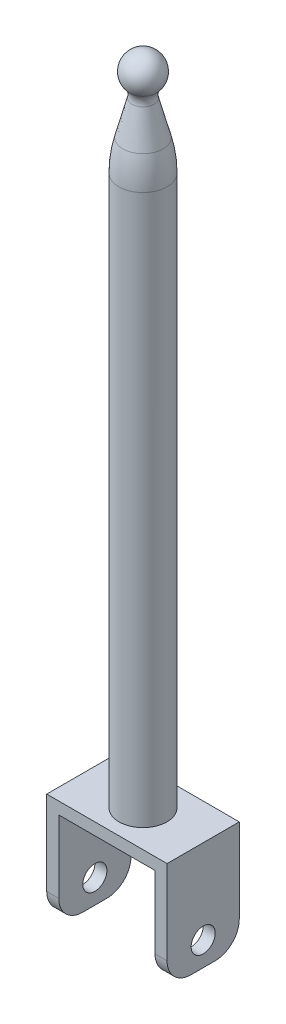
ISO-10303-21;
HEADER;
FILE_DESCRIPTION(('STEP AP214'),'2;1');
FILE_NAME('part.step','',(''),(''),'','','');
FILE_SCHEMA(('AUTOMOTIVE_DESIGN { 1 0 10303 214 1 1 1 1 }'));
ENDSEC;
DATA;
#1=APPLICATION_CONTEXT('core data for automotive mechanical design processes');
#2=APPLICATION_PROTOCOL_DEFINITION('international standard','automotive_design',2000,#1);
#3=PRODUCT_CONTEXT('',#1,'mechanical');
#4=PRODUCT('Part','Part','',(#3));
#5=PRODUCT_RELATED_PRODUCT_CATEGORY('part','',(#4));
#6=PRODUCT_DEFINITION_FORMATION('','',#4);
#7=PRODUCT_DEFINITION_CONTEXT('part definition',#1,'design');
#8=PRODUCT_DEFINITION('design','',#6,#7);
#9=PRODUCT_DEFINITION_SHAPE('','',#8);
#10=(LENGTH_UNIT() NAMED_UNIT(*) SI_UNIT(.MILLI.,.METRE.));
#11=(NAMED_UNIT(*) PLANE_ANGLE_UNIT() SI_UNIT($,.RADIAN.));
#12=(NAMED_UNIT(*) SI_UNIT($,.STERADIAN.) SOLID_ANGLE_UNIT());
#13=UNCERTAINTY_MEASURE_WITH_UNIT(LENGTH_MEASURE(1.E-05),#10,'distance_accuracy_value','');
#14=(GEOMETRIC_REPRESENTATION_CONTEXT(3) GLOBAL_UNCERTAINTY_ASSIGNED_CONTEXT((#13)) GLOBAL_UNIT_ASSIGNED_CONTEXT((#10,
#11,#12)) REPRESENTATION_CONTEXT('',''));
#15=CARTESIAN_POINT('',(0.,0.,0.));
#16=DIRECTION('',(0.,0.,1.));
#17=DIRECTION('',(1.,0.,0.));
#18=AXIS2_PLACEMENT_3D('',#15,#16,#17);
#19=CARTESIAN_POINT('',(0.,-9.99999999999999,0.));
#20=DIRECTION('',(0.,1.,0.));
#21=DIRECTION('',(0.,0.,1.));
#22=AXIS2_PLACEMENT_3D('',#19,#20,#21);
#23=PLANE('',#22);
#24=DIRECTION('',(0.,0.,1.));
#25=VECTOR('',#24,1.);
#26=CARTESIAN_POINT('',(25.,-9.99999999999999,-15.));
#27=LINE('',#26,#25);
#28=CARTESIAN_POINT('',(25.,-9.99999999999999,-5.));
#29=VERTEX_POINT('',#28);
#30=CARTESIAN_POINT('',(25.,-9.99999999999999,5.));
#31=VERTEX_POINT('',#30);
#32=EDGE_CURVE('E167',#29,#31,#27,.T.);
#33=ORIENTED_EDGE('',*,*,#32,.T.);
#34=DIRECTION('',(-1.,0.,0.));
#35=VECTOR('',#34,1.);
#36=CARTESIAN_POINT('',(0.,-9.99999999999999,5.));
#37=LINE('',#36,#35);
#38=CARTESIAN_POINT('',(20.,-9.99999999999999,5.));
#39=VERTEX_POINT('',#38);
#40=EDGE_CURVE('E214',#31,#39,#37,.T.);
#41=ORIENTED_EDGE('',*,*,#40,.T.);
#42=DIRECTION('',(0.,0.,1.));
#43=VECTOR('',#42,1.);
#44=CARTESIAN_POINT('',(20.,-9.99999999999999,-15.));
#45=LINE('',#44,#43);
#46=CARTESIAN_POINT('',(20.,-9.99999999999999,-5.));
#47=VERTEX_POINT('',#46);
#48=EDGE_CURVE('E147',#47,#39,#45,.T.);
#49=ORIENTED_EDGE('',*,*,#48,.F.);
#50=DIRECTION('',(1.,0.,0.));
#51=VECTOR('',#50,1.);
#52=CARTESIAN_POINT('',(0.,-9.99999999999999,-5.));
#53=LINE('',#52,#51);
#54=EDGE_CURVE('E206',#47,#29,#53,.T.);
#55=ORIENTED_EDGE('',*,*,#54,.T.);
#56=EDGE_LOOP('',(#33,#41,#49,#55));
#57=FACE_BOUND('',#56,.T.);
#58=ADVANCED_FACE('F34',(#57),#23,.F.);
#59=CARTESIAN_POINT('',(0.,331.861889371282,0.));
#60=DIRECTION('',(0.,1.,0.));
#61=DIRECTION('',(0.,0.,1.));
#62=AXIS2_PLACEMENT_3D('',#59,#60,#61);
#63=CYLINDRICAL_SURFACE('',#62,10.);
#64=CARTESIAN_POINT('',(0.,263.490847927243,0.));
#65=DIRECTION('',(0.,1.,0.));
#66=DIRECTION('',(0.,0.,1.));
#67=AXIS2_PLACEMENT_3D('',#64,#65,#66);
#68=CIRCLE('',#67,10.);
#69=CARTESIAN_POINT('',(0.,263.490847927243,10.));
#70=VERTEX_POINT('',#69);
#71=EDGE_CURVE('E203',#70,#70,#68,.T.);
#72=ORIENTED_EDGE('',*,*,#71,.F.);
#73=EDGE_LOOP('',(#72));
#74=FACE_BOUND('',#73,.T.);
#75=CARTESIAN_POINT('',(0.,35.,0.));
#76=DIRECTION('',(0.,-1.,0.));
#77=DIRECTION('',(0.,0.,-1.));
#78=AXIS2_PLACEMENT_3D('',#75,#76,#77);
#79=CIRCLE('',#78,10.);
#80=CARTESIAN_POINT('',(0.,35.,-10.));
#81=VERTEX_POINT('',#80);
#82=EDGE_CURVE('E191',#81,#81,#79,.T.);
#83=ORIENTED_EDGE('',*,*,#82,.F.);
#84=EDGE_LOOP('',(#83));
#85=FACE_BOUND('',#84,.T.);
#86=ADVANCED_FACE('F279',(#74,#85),#63,.T.);
#87=CARTESIAN_POINT('',(0.,263.490847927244,0.));
#88=DIRECTION('',(0.,1.,0.));
#89=DIRECTION('',(0.,0.,1.));
#90=AXIS2_PLACEMENT_3D('',#87,#88,#89);
#91=DEGENERATE_TOROIDAL_SURFACE('',#90,40.,50.,.F.);
#92=CARTESIAN_POINT('',(0.,276.292199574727,0.));
#93=DIRECTION('',(0.,1.,0.));
#94=DIRECTION('',(0.,0.,1.));
#95=AXIS2_PLACEMENT_3D('',#92,#93,#94);
#96=CIRCLE('',#95,8.33348110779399);
#97=CARTESIAN_POINT('',(0.,276.292199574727,8.33348110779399));
#98=VERTEX_POINT('',#97);
#99=EDGE_CURVE('E200',#98,#98,#96,.T.);
#100=ORIENTED_EDGE('',*,*,#99,.F.);
#101=EDGE_LOOP('',(#100));
#102=FACE_BOUND('',#101,.T.);
#103=ORIENTED_EDGE('',*,*,#71,.T.);
#104=EDGE_LOOP('',(#103));
#105=FACE_BOUND('',#104,.T.);
#106=ADVANCED_FACE('F281',(#102,#105),#91,.F.);
#107=CARTESIAN_POINT('',(0.,276.292199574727,0.));
#108=DIRECTION('',(0.,-1.,0.));
#109=DIRECTION('',(0.,0.,-1.));
#110=AXIS2_PLACEMENT_3D('',#107,#108,#109);
#111=CONICAL_SURFACE('',#110,8.33348110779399,0.258909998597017);
#112=CARTESIAN_POINT('',(0.,290.488248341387,0.));
#113=DIRECTION('',(0.,1.,0.));
#114=DIRECTION('',(0.,0.,1.));
#115=AXIS2_PLACEMENT_3D('',#112,#113,#114);
#116=CIRCLE('',#115,4.57359028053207);
#117=CARTESIAN_POINT('',(0.,290.488248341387,4.57359028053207));
#118=VERTEX_POINT('',#117);
#119=EDGE_CURVE('E197',#118,#118,#116,.T.);
#120=ORIENTED_EDGE('',*,*,#119,.F.);
#121=EDGE_LOOP('',(#120));
#122=FACE_BOUND('',#121,.T.);
#123=ORIENTED_EDGE('',*,*,#99,.T.);
#124=EDGE_LOOP('',(#123));
#125=FACE_BOUND('',#124,.T.);
#126=ADVANCED_FACE('F288',(#122,#125),#111,.T.);
#127=CARTESIAN_POINT('',(0.,291.768383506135,0.));
#128=DIRECTION('',(0.,1.,0.));
#129=DIRECTION('',(0.,0.,1.));
#130=AXIS2_PLACEMENT_3D('',#127,#128,#129);
#131=TOROIDAL_SURFACE('',#130,9.40693839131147,4.99999999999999);
#132=CARTESIAN_POINT('',(0.,295.061030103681,0.));
#133=DIRECTION('',(0.,1.,0.));
#134=DIRECTION('',(0.,0.,1.));
#135=AXIS2_PLACEMENT_3D('',#132,#133,#134);
#136=CIRCLE('',#135,5.64416303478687);
#137=CARTESIAN_POINT('',(0.,295.061030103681,5.64416303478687));
#138=VERTEX_POINT('',#137);
#139=EDGE_CURVE('E194',#138,#138,#136,.T.);
#140=ORIENTED_EDGE('',*,*,#139,.F.);
#141=EDGE_LOOP('',(#140));
#142=FACE_BOUND('',#141,.T.);
#143=ORIENTED_EDGE('',*,*,#119,.T.);
#144=EDGE_LOOP('',(#143));
#145=FACE_BOUND('',#144,.T.);
#146=ADVANCED_FACE('F433',(#142,#145),#131,.F.);
#147=CARTESIAN_POINT('',(0.,300.,0.));
#148=DIRECTION('',(0.,1.,0.));
#149=DIRECTION('',(1.,0.,0.));
#150=AXIS2_PLACEMENT_3D('',#147,#148,#149);
#151=SPHERICAL_SURFACE('',#150,7.50000000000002);
#152=ORIENTED_EDGE('',*,*,#139,.T.);
#153=EDGE_LOOP('',(#152));
#154=FACE_BOUND('',#153,.T.);
#155=ADVANCED_FACE('F275',(#154),#151,.T.);
#156=CARTESIAN_POINT('',(0.,35.,0.));
#157=DIRECTION('',(0.,1.,0.));
#158=DIRECTION('',(0.,0.,1.));
#159=AXIS2_PLACEMENT_3D('',#156,#157,#158);
#160=PLANE('',#159);
#161=DIRECTION('',(0.,0.,1.));
#162=VECTOR('',#161,1.);
#163=CARTESIAN_POINT('',(25.,35.,-15.));
#164=LINE('',#163,#162);
#165=CARTESIAN_POINT('',(25.,35.,-15.));
#166=VERTEX_POINT('',#165);
#167=CARTESIAN_POINT('',(25.,35.,15.));
#168=VERTEX_POINT('',#167);
#169=EDGE_CURVE('E135',#166,#168,#164,.T.);
#170=ORIENTED_EDGE('',*,*,#169,.F.);
#171=DIRECTION('',(1.,0.,0.));
#172=VECTOR('',#171,1.);
#173=CARTESIAN_POINT('',(-25.,35.,-15.));
#174=LINE('',#173,#172);
#175=CARTESIAN_POINT('',(-25.,35.,-15.));
#176=VERTEX_POINT('',#175);
#177=EDGE_CURVE('E171',#176,#166,#174,.T.);
#178=ORIENTED_EDGE('',*,*,#177,.F.);
#179=DIRECTION('',(0.,0.,-1.));
#180=VECTOR('',#179,1.);
#181=CARTESIAN_POINT('',(-25.,35.,-15.));
#182=LINE('',#181,#180);
#183=CARTESIAN_POINT('',(-25.,35.,15.));
#184=VERTEX_POINT('',#183);
#185=EDGE_CURVE('E179',#184,#176,#182,.T.);
#186=ORIENTED_EDGE('',*,*,#185,.F.);
#187=DIRECTION('',(-1.,0.,0.));
#188=VECTOR('',#187,1.);
#189=CARTESIAN_POINT('',(-25.,35.,15.));
#190=LINE('',#189,#188);
#191=EDGE_CURVE('E176',#168,#184,#190,.T.);
#192=ORIENTED_EDGE('',*,*,#191,.F.);
#193=EDGE_LOOP('',(#170,#178,#186,#192));
#194=FACE_BOUND('',#193,.T.);
#195=ORIENTED_EDGE('',*,*,#82,.T.);
#196=EDGE_LOOP('',(#195));
#197=FACE_BOUND('',#196,.T.);
#198=ADVANCED_FACE('F272',(#194,#197),#160,.T.);
#199=CARTESIAN_POINT('',(25.,-9.99999999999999,-15.));
#200=DIRECTION('',(-1.,0.,0.));
#201=DIRECTION('',(0.,0.,1.));
#202=AXIS2_PLACEMENT_3D('',#199,#200,#201);
#203=PLANE('',#202);
#204=CARTESIAN_POINT('',(25.,0.,0.));
#205=DIRECTION('',(-1.,0.,0.));
#206=DIRECTION('',(0.,0.,1.));
#207=AXIS2_PLACEMENT_3D('',#204,#205,#206);
#208=CIRCLE('',#207,5.);
#209=CARTESIAN_POINT('',(25.,0.,5.));
#210=VERTEX_POINT('',#209);
#211=EDGE_CURVE('E211',#210,#210,#208,.T.);
#212=ORIENTED_EDGE('',*,*,#211,.T.);
#213=EDGE_LOOP('',(#212));
#214=FACE_BOUND('',#213,.T.);
#215=DIRECTION('',(0.,1.,0.));
#216=VECTOR('',#215,1.);
#217=CARTESIAN_POINT('',(25.,-9.99999999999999,15.));
#218=LINE('',#217,#216);
#219=CARTESIAN_POINT('',(25.,0.,15.));
#220=VERTEX_POINT('',#219);
#221=EDGE_CURVE('E189',#220,#168,#218,.T.);
#222=ORIENTED_EDGE('',*,*,#221,.F.);
#223=CARTESIAN_POINT('',(25.,0.,5.));
#224=DIRECTION('',(-1.,0.,0.));
#225=DIRECTION('',(0.,0.,1.));
#226=AXIS2_PLACEMENT_3D('',#223,#224,#225);
#227=CIRCLE('',#226,10.);
#228=EDGE_CURVE('E227',#220,#31,#227,.F.);
#229=ORIENTED_EDGE('',*,*,#228,.T.);
#230=ORIENTED_EDGE('',*,*,#32,.F.);
#231=CARTESIAN_POINT('',(25.,0.,-5.));
#232=DIRECTION('',(-1.,0.,0.));
#233=DIRECTION('',(0.,0.,1.));
#234=AXIS2_PLACEMENT_3D('',#231,#232,#233);
#235=CIRCLE('',#234,10.);
#236=CARTESIAN_POINT('',(25.,0.,-15.));
#237=VERTEX_POINT('',#236);
#238=EDGE_CURVE('E225',#29,#237,#235,.F.);
#239=ORIENTED_EDGE('',*,*,#238,.T.);
#240=DIRECTION('',(0.,1.,0.));
#241=VECTOR('',#240,1.);
#242=CARTESIAN_POINT('',(25.,-9.99999999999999,-15.));
#243=LINE('',#242,#241);
#244=EDGE_CURVE('E173',#237,#166,#243,.T.);
#245=ORIENTED_EDGE('',*,*,#244,.T.);
#246=ORIENTED_EDGE('',*,*,#169,.T.);
#247=EDGE_LOOP('',(#222,#229,#230,#239,#245,#246));
#248=FACE_BOUND('',#247,.T.);
#249=ADVANCED_FACE('F263',(#214,#248),#203,.F.);
#250=CARTESIAN_POINT('',(-25.,-9.99999999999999,15.));
#251=DIRECTION('',(0.,0.,-1.));
#252=DIRECTION('',(-1.,0.,0.));
#253=AXIS2_PLACEMENT_3D('',#250,#251,#252);
#254=PLANE('',#253);
#255=DIRECTION('',(0.,-1.,0.));
#256=VECTOR('',#255,1.);
#257=CARTESIAN_POINT('',(20.,30.,15.));
#258=LINE('',#257,#256);
#259=CARTESIAN_POINT('',(20.,30.,15.));
#260=VERTEX_POINT('',#259);
#261=CARTESIAN_POINT('',(20.,0.,15.));
#262=VERTEX_POINT('',#261);
#263=EDGE_CURVE('E146',#260,#262,#258,.T.);
#264=ORIENTED_EDGE('',*,*,#263,.T.);
#265=DIRECTION('',(-1.,0.,0.));
#266=VECTOR('',#265,1.);
#267=CARTESIAN_POINT('',(-25.,0.,15.));
#268=LINE('',#267,#266);
#269=EDGE_CURVE('E223',#262,#220,#268,.F.);
#270=ORIENTED_EDGE('',*,*,#269,.T.);
#271=ORIENTED_EDGE('',*,*,#221,.T.);
#272=ORIENTED_EDGE('',*,*,#191,.T.);
#273=DIRECTION('',(0.,1.,0.));
#274=VECTOR('',#273,1.);
#275=CARTESIAN_POINT('',(-25.,-9.99999999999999,15.));
#276=LINE('',#275,#274);
#277=CARTESIAN_POINT('',(-25.,0.,15.));
#278=VERTEX_POINT('',#277);
#279=EDGE_CURVE('E187',#278,#184,#276,.T.);
#280=ORIENTED_EDGE('',*,*,#279,.F.);
#281=DIRECTION('',(-1.,0.,0.));
#282=VECTOR('',#281,1.);
#283=CARTESIAN_POINT('',(-25.,0.,15.));
#284=LINE('',#283,#282);
#285=CARTESIAN_POINT('',(-20.,0.,15.));
#286=VERTEX_POINT('',#285);
#287=EDGE_CURVE('E221',#278,#286,#284,.F.);
#288=ORIENTED_EDGE('',*,*,#287,.T.);
#289=DIRECTION('',(0.,-1.,0.));
#290=VECTOR('',#289,1.);
#291=CARTESIAN_POINT('',(-20.,30.,15.));
#292=LINE('',#291,#290);
#293=CARTESIAN_POINT('',(-20.,30.,15.));
#294=VERTEX_POINT('',#293);
#295=EDGE_CURVE('E159',#294,#286,#292,.T.);
#296=ORIENTED_EDGE('',*,*,#295,.F.);
#297=DIRECTION('',(-1.,0.,0.));
#298=VECTOR('',#297,1.);
#299=CARTESIAN_POINT('',(-15.,30.,15.));
#300=LINE('',#299,#298);
#301=EDGE_CURVE('E136',#260,#294,#300,.T.);
#302=ORIENTED_EDGE('',*,*,#301,.F.);
#303=EDGE_LOOP('',(#264,#270,#271,#272,#280,#288,#296,#302));
#304=FACE_BOUND('',#303,.T.);
#305=ADVANCED_FACE('F249',(#304),#254,.F.);
#306=CARTESIAN_POINT('',(-25.,-9.99999999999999,-15.));
#307=DIRECTION('',(1.,0.,0.));
#308=DIRECTION('',(0.,0.,-1.));
#309=AXIS2_PLACEMENT_3D('',#306,#307,#308);
#310=PLANE('',#309);
#311=CARTESIAN_POINT('',(-25.,0.,0.));
#312=DIRECTION('',(-1.,0.,0.));
#313=DIRECTION('',(0.,0.,1.));
#314=AXIS2_PLACEMENT_3D('',#311,#312,#313);
#315=CIRCLE('',#314,5.);
#316=CARTESIAN_POINT('',(-25.,0.,5.));
#317=VERTEX_POINT('',#316);
#318=EDGE_CURVE('E475',#317,#317,#315,.T.);
#319=ORIENTED_EDGE('',*,*,#318,.F.);
#320=EDGE_LOOP('',(#319));
#321=FACE_BOUND('',#320,.T.);
#322=DIRECTION('',(0.,0.,-1.));
#323=VECTOR('',#322,1.);
#324=CARTESIAN_POINT('',(-25.,-9.99999999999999,-15.));
#325=LINE('',#324,#323);
#326=CARTESIAN_POINT('',(-25.,-9.99999999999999,5.));
#327=VERTEX_POINT('',#326);
#328=CARTESIAN_POINT('',(-25.,-9.99999999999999,-5.));
#329=VERTEX_POINT('',#328);
#330=EDGE_CURVE('E170',#327,#329,#325,.T.);
#331=ORIENTED_EDGE('',*,*,#330,.F.);
#332=CARTESIAN_POINT('',(-25.,0.,5.));
#333=DIRECTION('',(1.,0.,0.));
#334=DIRECTION('',(0.,0.,-1.));
#335=AXIS2_PLACEMENT_3D('',#332,#333,#334);
#336=CIRCLE('',#335,10.);
#337=EDGE_CURVE('E57',#327,#278,#336,.F.);
#338=ORIENTED_EDGE('',*,*,#337,.T.);
#339=ORIENTED_EDGE('',*,*,#279,.T.);
#340=ORIENTED_EDGE('',*,*,#185,.T.);
#341=DIRECTION('',(0.,1.,0.));
#342=VECTOR('',#341,1.);
#343=CARTESIAN_POINT('',(-25.,-9.99999999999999,-15.));
#344=LINE('',#343,#342);
#345=CARTESIAN_POINT('',(-25.,0.,-15.));
#346=VERTEX_POINT('',#345);
#347=EDGE_CURVE('E185',#346,#176,#344,.T.);
#348=ORIENTED_EDGE('',*,*,#347,.F.);
#349=CARTESIAN_POINT('',(-25.,0.,-5.));
#350=DIRECTION('',(1.,0.,0.));
#351=DIRECTION('',(0.,0.,-1.));
#352=AXIS2_PLACEMENT_3D('',#349,#350,#351);
#353=CIRCLE('',#352,10.);
#354=EDGE_CURVE('E49',#346,#329,#353,.F.);
#355=ORIENTED_EDGE('',*,*,#354,.T.);
#356=EDGE_LOOP('',(#331,#338,#339,#340,#348,#355));
#357=FACE_BOUND('',#356,.T.);
#358=ADVANCED_FACE('F246',(#321,#357),#310,.F.);
#359=CARTESIAN_POINT('',(-25.,-9.99999999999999,-15.));
#360=DIRECTION('',(0.,0.,1.));
#361=DIRECTION('',(1.,0.,0.));
#362=AXIS2_PLACEMENT_3D('',#359,#360,#361);
#363=PLANE('',#362);
#364=ORIENTED_EDGE('',*,*,#244,.F.);
#365=DIRECTION('',(1.,0.,0.));
#366=VECTOR('',#365,1.);
#367=CARTESIAN_POINT('',(-25.,0.,-15.));
#368=LINE('',#367,#366);
#369=CARTESIAN_POINT('',(20.,0.,-15.));
#370=VERTEX_POINT('',#369);
#371=EDGE_CURVE('E152',#237,#370,#368,.F.);
#372=ORIENTED_EDGE('',*,*,#371,.T.);
#373=DIRECTION('',(0.,-1.,0.));
#374=VECTOR('',#373,1.);
#375=CARTESIAN_POINT('',(20.,30.,-15.));
#376=LINE('',#375,#374);
#377=CARTESIAN_POINT('',(20.,30.,-15.));
#378=VERTEX_POINT('',#377);
#379=EDGE_CURVE('E143',#378,#370,#376,.T.);
#380=ORIENTED_EDGE('',*,*,#379,.F.);
#381=DIRECTION('',(1.,0.,0.));
#382=VECTOR('',#381,1.);
#383=CARTESIAN_POINT('',(-15.,30.,-15.));
#384=LINE('',#383,#382);
#385=CARTESIAN_POINT('',(-20.,30.,-15.));
#386=VERTEX_POINT('',#385);
#387=EDGE_CURVE('E125',#386,#378,#384,.T.);
#388=ORIENTED_EDGE('',*,*,#387,.F.);
#389=DIRECTION('',(0.,-1.,0.));
#390=VECTOR('',#389,1.);
#391=CARTESIAN_POINT('',(-20.,30.,-15.));
#392=LINE('',#391,#390);
#393=CARTESIAN_POINT('',(-20.,0.,-15.));
#394=VERTEX_POINT('',#393);
#395=EDGE_CURVE('E162',#386,#394,#392,.T.);
#396=ORIENTED_EDGE('',*,*,#395,.T.);
#397=DIRECTION('',(1.,0.,0.));
#398=VECTOR('',#397,1.);
#399=CARTESIAN_POINT('',(-25.,0.,-15.));
#400=LINE('',#399,#398);
#401=EDGE_CURVE('E229',#394,#346,#400,.F.);
#402=ORIENTED_EDGE('',*,*,#401,.T.);
#403=ORIENTED_EDGE('',*,*,#347,.T.);
#404=ORIENTED_EDGE('',*,*,#177,.T.);
#405=EDGE_LOOP('',(#364,#372,#380,#388,#396,#402,#403,#404));
#406=FACE_BOUND('',#405,.T.);
#407=ADVANCED_FACE('F150',(#406),#363,.F.);
#408=DIRECTION('',(0.,0.,-1.));
#409=VECTOR('',#408,1.);
#410=CARTESIAN_POINT('',(-20.,-9.99999999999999,-15.));
#411=LINE('',#410,#409);
#412=CARTESIAN_POINT('',(-20.,-9.99999999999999,5.));
#413=VERTEX_POINT('',#412);
#414=CARTESIAN_POINT('',(-20.,-9.99999999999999,-5.));
#415=VERTEX_POINT('',#414);
#416=EDGE_CURVE('E154',#413,#415,#411,.T.);
#417=ORIENTED_EDGE('',*,*,#416,.F.);
#418=DIRECTION('',(-1.,0.,0.));
#419=VECTOR('',#418,1.);
#420=CARTESIAN_POINT('',(0.,-9.99999999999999,5.));
#421=LINE('',#420,#419);
#422=EDGE_CURVE('E235',#413,#327,#421,.T.);
#423=ORIENTED_EDGE('',*,*,#422,.T.);
#424=ORIENTED_EDGE('',*,*,#330,.T.);
#425=DIRECTION('',(1.,0.,0.));
#426=VECTOR('',#425,1.);
#427=CARTESIAN_POINT('',(0.,-9.99999999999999,-5.));
#428=LINE('',#427,#426);
#429=EDGE_CURVE('E232',#329,#415,#428,.T.);
#430=ORIENTED_EDGE('',*,*,#429,.T.);
#431=EDGE_LOOP('',(#417,#423,#424,#430));
#432=FACE_BOUND('',#431,.T.);
#433=ADVANCED_FACE('F245',(#432),#23,.F.);
#434=CARTESIAN_POINT('',(0.,30.,0.));
#435=DIRECTION('',(0.,1.,0.));
#436=DIRECTION('',(0.,0.,1.));
#437=AXIS2_PLACEMENT_3D('',#434,#435,#436);
#438=PLANE('',#437);
#439=ORIENTED_EDGE('',*,*,#387,.T.);
#440=DIRECTION('',(0.,0.,1.));
#441=VECTOR('',#440,1.);
#442=CARTESIAN_POINT('',(20.,30.,-15.));
#443=LINE('',#442,#441);
#444=EDGE_CURVE('E128',#378,#260,#443,.T.);
#445=ORIENTED_EDGE('',*,*,#444,.T.);
#446=ORIENTED_EDGE('',*,*,#301,.T.);
#447=DIRECTION('',(0.,0.,-1.));
#448=VECTOR('',#447,1.);
#449=CARTESIAN_POINT('',(-20.,30.,-15.));
#450=LINE('',#449,#448);
#451=EDGE_CURVE('E130',#294,#386,#450,.T.);
#452=ORIENTED_EDGE('',*,*,#451,.T.);
#453=EDGE_LOOP('',(#439,#445,#446,#452));
#454=FACE_BOUND('',#453,.T.);
#455=ADVANCED_FACE('F127',(#454),#438,.F.);
#456=CARTESIAN_POINT('',(-20.,30.,-15.));
#457=DIRECTION('',(-1.,0.,0.));
#458=DIRECTION('',(0.,0.,1.));
#459=AXIS2_PLACEMENT_3D('',#456,#457,#458);
#460=PLANE('',#459);
#461=CARTESIAN_POINT('',(-20.,0.,0.));
#462=DIRECTION('',(-1.,0.,0.));
#463=DIRECTION('',(0.,0.,1.));
#464=AXIS2_PLACEMENT_3D('',#461,#462,#463);
#465=CIRCLE('',#464,5.);
#466=CARTESIAN_POINT('',(-20.,0.,5.));
#467=VERTEX_POINT('',#466);
#468=EDGE_CURVE('E210',#467,#467,#465,.T.);
#469=ORIENTED_EDGE('',*,*,#468,.T.);
#470=EDGE_LOOP('',(#469));
#471=FACE_BOUND('',#470,.T.);
#472=ORIENTED_EDGE('',*,*,#295,.T.);
#473=CARTESIAN_POINT('',(-20.,0.,5.));
#474=DIRECTION('',(-1.,0.,0.));
#475=DIRECTION('',(0.,0.,1.));
#476=AXIS2_PLACEMENT_3D('',#473,#474,#475);
#477=CIRCLE('',#476,10.);
#478=EDGE_CURVE('E11',#286,#413,#477,.F.);
#479=ORIENTED_EDGE('',*,*,#478,.T.);
#480=ORIENTED_EDGE('',*,*,#416,.T.);
#481=CARTESIAN_POINT('',(-20.,0.,-5.));
#482=DIRECTION('',(-1.,0.,0.));
#483=DIRECTION('',(0.,0.,1.));
#484=AXIS2_PLACEMENT_3D('',#481,#482,#483);
#485=CIRCLE('',#484,10.);
#486=EDGE_CURVE('E42',#415,#394,#485,.F.);
#487=ORIENTED_EDGE('',*,*,#486,.T.);
#488=ORIENTED_EDGE('',*,*,#395,.F.);
#489=ORIENTED_EDGE('',*,*,#451,.F.);
#490=EDGE_LOOP('',(#472,#479,#480,#487,#488,#489));
#491=FACE_BOUND('',#490,.T.);
#492=ADVANCED_FACE('F239',(#471,#491),#460,.F.);
#493=CARTESIAN_POINT('',(20.,30.,-15.));
#494=DIRECTION('',(1.,0.,0.));
#495=DIRECTION('',(0.,0.,-1.));
#496=AXIS2_PLACEMENT_3D('',#493,#494,#495);
#497=PLANE('',#496);
#498=CARTESIAN_POINT('',(20.,0.,0.));
#499=DIRECTION('',(1.,0.,0.));
#500=DIRECTION('',(0.,0.,-1.));
#501=AXIS2_PLACEMENT_3D('',#498,#499,#500);
#502=CIRCLE('',#501,5.);
#503=CARTESIAN_POINT('',(20.,0.,-5.));
#504=VERTEX_POINT('',#503);
#505=EDGE_CURVE('E207',#504,#504,#502,.T.);
#506=ORIENTED_EDGE('',*,*,#505,.T.);
#507=EDGE_LOOP('',(#506));
#508=FACE_BOUND('',#507,.T.);
#509=ORIENTED_EDGE('',*,*,#48,.T.);
#510=CARTESIAN_POINT('',(20.,0.,5.));
#511=DIRECTION('',(1.,0.,0.));
#512=DIRECTION('',(0.,0.,-1.));
#513=AXIS2_PLACEMENT_3D('',#510,#511,#512);
#514=CIRCLE('',#513,10.);
#515=EDGE_CURVE('E219',#39,#262,#514,.F.);
#516=ORIENTED_EDGE('',*,*,#515,.T.);
#517=ORIENTED_EDGE('',*,*,#263,.F.);
#518=ORIENTED_EDGE('',*,*,#444,.F.);
#519=ORIENTED_EDGE('',*,*,#379,.T.);
#520=CARTESIAN_POINT('',(20.,0.,-5.));
#521=DIRECTION('',(1.,0.,0.));
#522=DIRECTION('',(0.,0.,-1.));
#523=AXIS2_PLACEMENT_3D('',#520,#521,#522);
#524=CIRCLE('',#523,10.);
#525=EDGE_CURVE('E217',#370,#47,#524,.F.);
#526=ORIENTED_EDGE('',*,*,#525,.T.);
#527=EDGE_LOOP('',(#509,#516,#517,#518,#519,#526));
#528=FACE_BOUND('',#527,.T.);
#529=ADVANCED_FACE('F142',(#508,#528),#497,.F.);
#530=CARTESIAN_POINT('',(25.,0.,0.));
#531=DIRECTION('',(-1.,0.,0.));
#532=DIRECTION('',(0.,0.,1.));
#533=AXIS2_PLACEMENT_3D('',#530,#531,#532);
#534=CYLINDRICAL_SURFACE('',#533,5.);
#535=ORIENTED_EDGE('',*,*,#211,.F.);
#536=EDGE_LOOP('',(#535));
#537=FACE_BOUND('',#536,.T.);
#538=ORIENTED_EDGE('',*,*,#505,.F.);
#539=EDGE_LOOP('',(#538));
#540=FACE_BOUND('',#539,.T.);
#541=ADVANCED_FACE('F332',(#537,#540),#534,.F.);
#542=ORIENTED_EDGE('',*,*,#318,.T.);
#543=EDGE_LOOP('',(#542));
#544=FACE_BOUND('',#543,.T.);
#545=ORIENTED_EDGE('',*,*,#468,.F.);
#546=EDGE_LOOP('',(#545));
#547=FACE_BOUND('',#546,.T.);
#548=ADVANCED_FACE('F297',(#544,#547),#534,.F.);
#549=CARTESIAN_POINT('',(0.,0.,5.));
#550=DIRECTION('',(-1.,0.,0.));
#551=DIRECTION('',(0.,0.,1.));
#552=AXIS2_PLACEMENT_3D('',#549,#550,#551);
#553=CYLINDRICAL_SURFACE('',#552,10.);
#554=ORIENTED_EDGE('',*,*,#228,.F.);
#555=ORIENTED_EDGE('',*,*,#269,.F.);
#556=ORIENTED_EDGE('',*,*,#515,.F.);
#557=ORIENTED_EDGE('',*,*,#40,.F.);
#558=EDGE_LOOP('',(#554,#555,#556,#557));
#559=FACE_BOUND('',#558,.T.);
#560=ADVANCED_FACE('F259',(#559),#553,.T.);
#561=CARTESIAN_POINT('',(0.,0.,-5.));
#562=DIRECTION('',(1.,0.,0.));
#563=DIRECTION('',(0.,0.,-1.));
#564=AXIS2_PLACEMENT_3D('',#561,#562,#563);
#565=CYLINDRICAL_SURFACE('',#564,10.);
#566=ORIENTED_EDGE('',*,*,#525,.F.);
#567=ORIENTED_EDGE('',*,*,#371,.F.);
#568=ORIENTED_EDGE('',*,*,#238,.F.);
#569=ORIENTED_EDGE('',*,*,#54,.F.);
#570=EDGE_LOOP('',(#566,#567,#568,#569));
#571=FACE_BOUND('',#570,.T.);
#572=ADVANCED_FACE('F268',(#571),#565,.T.);
#573=CARTESIAN_POINT('',(0.,0.,5.));
#574=DIRECTION('',(-1.,0.,0.));
#575=DIRECTION('',(0.,0.,1.));
#576=AXIS2_PLACEMENT_3D('',#573,#574,#575);
#577=CYLINDRICAL_SURFACE('',#576,10.);
#578=ORIENTED_EDGE('',*,*,#478,.F.);
#579=ORIENTED_EDGE('',*,*,#287,.F.);
#580=ORIENTED_EDGE('',*,*,#337,.F.);
#581=ORIENTED_EDGE('',*,*,#422,.F.);
#582=EDGE_LOOP('',(#578,#579,#580,#581));
#583=FACE_BOUND('',#582,.T.);
#584=ADVANCED_FACE('F254',(#583),#577,.T.);
#585=CARTESIAN_POINT('',(0.,0.,-5.));
#586=DIRECTION('',(1.,0.,0.));
#587=DIRECTION('',(0.,0.,-1.));
#588=AXIS2_PLACEMENT_3D('',#585,#586,#587);
#589=CYLINDRICAL_SURFACE('',#588,10.);
#590=ORIENTED_EDGE('',*,*,#354,.F.);
#591=ORIENTED_EDGE('',*,*,#401,.F.);
#592=ORIENTED_EDGE('',*,*,#486,.F.);
#593=ORIENTED_EDGE('',*,*,#429,.F.);
#594=EDGE_LOOP('',(#590,#591,#592,#593));
#595=FACE_BOUND('',#594,.T.);
#596=ADVANCED_FACE('F36',(#595),#589,.T.);
#597=CLOSED_SHELL('',(#58,#86,#106,#126,#146,#155,#198,#249,#305,#358,#407,#433,#455,#492,#529,
#541,#548,#560,#572,#584,#596));
#598=MANIFOLD_SOLID_BREP('B2',#597);
#599=ADVANCED_BREP_SHAPE_REPRESENTATION('',(#18,#598),#14);
#600=SHAPE_DEFINITION_REPRESENTATION(#9,#599);
ENDSEC;
END-ISO-10303-21;
